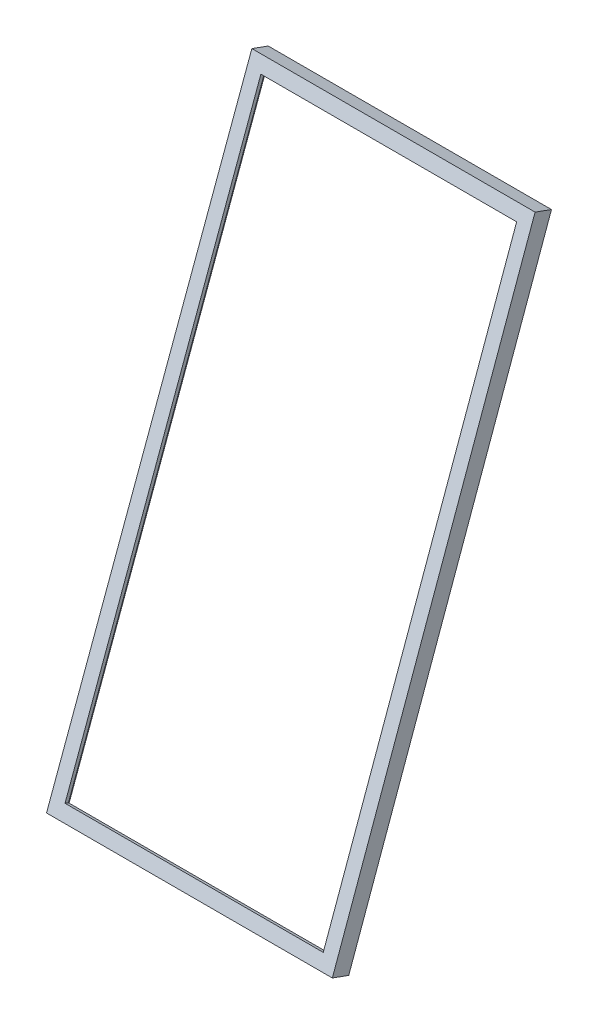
ISO-10303-21;
HEADER;
FILE_DESCRIPTION(('STEP AP214'),'2;1');
FILE_NAME('part.step','',(''),(''),'','','');
FILE_SCHEMA(('AUTOMOTIVE_DESIGN { 1 0 10303 214 1 1 1 1 }'));
ENDSEC;
DATA;
#1=APPLICATION_CONTEXT('core data for automotive mechanical design processes');
#2=APPLICATION_PROTOCOL_DEFINITION('international standard','automotive_design',2000,#1);
#3=PRODUCT_CONTEXT('',#1,'mechanical');
#4=PRODUCT('Part','Part','',(#3));
#5=PRODUCT_RELATED_PRODUCT_CATEGORY('part','',(#4));
#6=PRODUCT_DEFINITION_FORMATION('','',#4);
#7=PRODUCT_DEFINITION_CONTEXT('part definition',#1,'design');
#8=PRODUCT_DEFINITION('design','',#6,#7);
#9=PRODUCT_DEFINITION_SHAPE('','',#8);
#10=(LENGTH_UNIT() NAMED_UNIT(*) SI_UNIT(.MILLI.,.METRE.));
#11=(NAMED_UNIT(*) PLANE_ANGLE_UNIT() SI_UNIT($,.RADIAN.));
#12=(NAMED_UNIT(*) SI_UNIT($,.STERADIAN.) SOLID_ANGLE_UNIT());
#13=UNCERTAINTY_MEASURE_WITH_UNIT(LENGTH_MEASURE(1.E-05),#10,'distance_accuracy_value','');
#14=(GEOMETRIC_REPRESENTATION_CONTEXT(3) GLOBAL_UNCERTAINTY_ASSIGNED_CONTEXT((#13)) GLOBAL_UNIT_ASSIGNED_CONTEXT((#10,
#11,#12)) REPRESENTATION_CONTEXT('',''));
#15=CARTESIAN_POINT('',(0.,0.,0.));
#16=DIRECTION('',(0.,0.,1.));
#17=DIRECTION('',(1.,0.,0.));
#18=AXIS2_PLACEMENT_3D('',#15,#16,#17);
#19=CARTESIAN_POINT('',(1481.83846153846,63.6363802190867,-44.445303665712));
#20=DIRECTION('',(0.,0.939692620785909,-0.342020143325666));
#21=DIRECTION('',(0.,0.342020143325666,0.93969262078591));
#22=AXIS2_PLACEMENT_3D('',#19,#20,#21);
#23=PLANE('',#22);
#24=DIRECTION('',(-1.,0.,0.));
#25=VECTOR('',#24,1.);
#26=CARTESIAN_POINT('',(1481.83846153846,63.6363802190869,-44.4453036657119));
#27=LINE('',#26,#25);
#28=CARTESIAN_POINT('',(1481.83846153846,63.6363802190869,-44.4453036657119));
#29=VERTEX_POINT('',#28);
#30=CARTESIAN_POINT('',(75.1615384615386,63.6363802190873,-44.4453036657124));
#31=VERTEX_POINT('',#30);
#32=EDGE_CURVE('E187',#29,#31,#27,.T.);
#33=ORIENTED_EDGE('',*,*,#32,.T.);
#34=CARTESIAN_POINT('',(75.1615384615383,63.6363802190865,-44.4453036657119));
#35=DIRECTION('',(0.,0.342020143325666,0.939692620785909));
#36=VECTOR('',#35,1.);
#37=LINE('',#34,#36);
#38=CARTESIAN_POINT('',(75.1615384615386,70.4767830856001,-25.651451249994));
#39=VERTEX_POINT('',#38);
#40=EDGE_CURVE('E53',#31,#39,#37,.T.);
#41=ORIENTED_EDGE('',*,*,#40,.T.);
#42=DIRECTION('',(-1.,0.,0.));
#43=VECTOR('',#42,1.);
#44=CARTESIAN_POINT('',(1481.83846153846,70.4767830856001,-25.6514512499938));
#45=LINE('',#44,#43);
#46=CARTESIAN_POINT('',(1481.83846153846,70.4767830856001,-25.6514512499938));
#47=VERTEX_POINT('',#46);
#48=EDGE_CURVE('E178',#47,#39,#45,.T.);
#49=ORIENTED_EDGE('',*,*,#48,.F.);
#50=DIRECTION('',(0.,-0.342020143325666,-0.939692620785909));
#51=VECTOR('',#50,1.);
#52=CARTESIAN_POINT('',(1481.83846153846,63.6363802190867,-44.445303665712));
#53=LINE('',#52,#51);
#54=EDGE_CURVE('E263',#47,#29,#53,.T.);
#55=ORIENTED_EDGE('',*,*,#54,.T.);
#56=EDGE_LOOP('',(#33,#41,#49,#55));
#57=FACE_BOUND('',#56,.T.);
#58=ADVANCED_FACE('F42',(#57),#23,.T.);
#59=CARTESIAN_POINT('',(1557.,4.44089209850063E-13,2.22044604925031E-13));
#60=DIRECTION('',(0.,-0.939692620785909,0.342020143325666));
#61=DIRECTION('',(0.,-0.342020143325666,-0.939692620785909));
#62=AXIS2_PLACEMENT_3D('',#59,#60,#61);
#63=PLANE('',#62);
#64=DIRECTION('',(-1.,0.,0.));
#65=VECTOR('',#64,1.);
#66=CARTESIAN_POINT('',(1557.,1.60388440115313E-13,0.));
#67=LINE('',#66,#65);
#68=CARTESIAN_POINT('',(1557.,1.60388440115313E-13,0.));
#69=VERTEX_POINT('',#68);
#70=CARTESIAN_POINT('',(-1.10588621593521E-13,3.33066907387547E-13,-1.66533453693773E-13));
#71=VERTEX_POINT('',#70);
#72=EDGE_CURVE('E186',#69,#71,#67,.T.);
#73=ORIENTED_EDGE('',*,*,#72,.T.);
#74=CARTESIAN_POINT('',(4.44089209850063E-13,1.64183213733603E-13,0.));
#75=DIRECTION('',(0.,-0.342020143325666,-0.939692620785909));
#76=VECTOR('',#75,1.);
#77=LINE('',#74,#76);
#78=CARTESIAN_POINT('',(0.,-32.4919136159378,-89.2707989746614));
#79=VERTEX_POINT('',#78);
#80=EDGE_CURVE('E12',#71,#79,#77,.T.);
#81=ORIENTED_EDGE('',*,*,#80,.T.);
#82=DIRECTION('',(-1.,0.,0.));
#83=VECTOR('',#82,1.);
#84=CARTESIAN_POINT('',(1557.,-32.4919136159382,-89.2707989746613));
#85=LINE('',#84,#83);
#86=CARTESIAN_POINT('',(1557.,-32.4919136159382,-89.2707989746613));
#87=VERTEX_POINT('',#86);
#88=EDGE_CURVE('E227',#87,#79,#85,.T.);
#89=ORIENTED_EDGE('',*,*,#88,.F.);
#90=DIRECTION('',(0.,0.342020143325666,0.939692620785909));
#91=VECTOR('',#90,1.);
#92=CARTESIAN_POINT('',(1557.,4.44089209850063E-13,2.22044604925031E-13));
#93=LINE('',#92,#91);
#94=EDGE_CURVE('E267',#87,#69,#93,.T.);
#95=ORIENTED_EDGE('',*,*,#94,.T.);
#96=EDGE_LOOP('',(#73,#81,#89,#95));
#97=FACE_BOUND('',#96,.T.);
#98=ADVANCED_FACE('F207',(#97),#63,.T.);
#99=CARTESIAN_POINT('',(1536.95692307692,-13.6981047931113,-96.1111859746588));
#100=DIRECTION('',(0.,0.939692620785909,-0.342020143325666));
#101=DIRECTION('',(0.,0.342020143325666,0.939692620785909));
#102=AXIS2_PLACEMENT_3D('',#99,#100,#101);
#103=PLANE('',#102);
#104=DIRECTION('',(-1.,0.,0.));
#105=VECTOR('',#104,1.);
#106=CARTESIAN_POINT('',(1536.95692307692,-13.6981047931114,-96.1111859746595));
#107=LINE('',#106,#105);
#108=CARTESIAN_POINT('',(1536.95692307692,-13.6981047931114,-96.1111859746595));
#109=VERTEX_POINT('',#108);
#110=CARTESIAN_POINT('',(20.0430769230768,-13.6981047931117,-96.1111859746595));
#111=VERTEX_POINT('',#110);
#112=EDGE_CURVE('E233',#109,#111,#107,.T.);
#113=ORIENTED_EDGE('',*,*,#112,.T.);
#114=CARTESIAN_POINT('',(20.0430769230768,-13.6981047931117,-96.1111859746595));
#115=DIRECTION('',(0.,0.342020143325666,0.939692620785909));
#116=VECTOR('',#115,1.);
#117=LINE('',#114,#116);
#118=CARTESIAN_POINT('',(20.0430769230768,11.9534059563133,-25.6342394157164));
#119=VERTEX_POINT('',#118);
#120=EDGE_CURVE('E63',#111,#119,#117,.T.);
#121=ORIENTED_EDGE('',*,*,#120,.T.);
#122=DIRECTION('',(-1.,0.,0.));
#123=VECTOR('',#122,1.);
#124=CARTESIAN_POINT('',(1536.95692307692,11.9534059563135,-25.6342394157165));
#125=LINE('',#124,#123);
#126=CARTESIAN_POINT('',(1536.95692307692,11.9534059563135,-25.6342394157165));
#127=VERTEX_POINT('',#126);
#128=EDGE_CURVE('E74',#127,#119,#125,.T.);
#129=ORIENTED_EDGE('',*,*,#128,.F.);
#130=DIRECTION('',(0.,-0.342020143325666,-0.939692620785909));
#131=VECTOR('',#130,1.);
#132=CARTESIAN_POINT('',(1536.95692307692,-13.6981047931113,-96.1111859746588));
#133=LINE('',#132,#131);
#134=EDGE_CURVE('E259',#127,#109,#133,.T.);
#135=ORIENTED_EDGE('',*,*,#134,.T.);
#136=EDGE_LOOP('',(#113,#121,#129,#135));
#137=FACE_BOUND('',#136,.T.);
#138=ADVANCED_FACE('F44',(#137),#103,.T.);
#139=CARTESIAN_POINT('',(1475.16153846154,2976.6767477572,-1104.70528866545));
#140=DIRECTION('',(0.999997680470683,0.00202395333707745,-0.000736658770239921));
#141=DIRECTION('',(-0.00202395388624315,0.999997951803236,0.));
#142=AXIS2_PLACEMENT_3D('',#139,#140,#141);
#143=PLANE('',#142);
#144=ORIENTED_EDGE('',*,*,#54,.F.);
#145=DIRECTION('',(0.00215384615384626,-0.939690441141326,0.342019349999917));
#146=VECTOR('',#145,1.);
#147=CARTESIAN_POINT('',(1475.16153846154,2983.51715062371,-1085.91143624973));
#148=LINE('',#147,#146);
#149=CARTESIAN_POINT('',(1475.16153846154,2983.51715062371,-1085.91143624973));
#150=VERTEX_POINT('',#149);
#151=EDGE_CURVE('E181',#150,#47,#148,.T.);
#152=ORIENTED_EDGE('',*,*,#151,.F.);
#153=DIRECTION('',(0.,0.342020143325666,0.939692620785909));
#154=VECTOR('',#153,1.);
#155=CARTESIAN_POINT('',(1475.16153846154,2976.6767477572,-1104.70528866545));
#156=LINE('',#155,#154);
#157=CARTESIAN_POINT('',(1475.16153846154,2976.6767477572,-1104.70528866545));
#158=VERTEX_POINT('',#157);
#159=EDGE_CURVE('E290',#158,#150,#156,.T.);
#160=ORIENTED_EDGE('',*,*,#159,.F.);
#161=DIRECTION('',(0.00215384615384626,-0.939690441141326,0.342019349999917));
#162=VECTOR('',#161,1.);
#163=CARTESIAN_POINT('',(1475.16153846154,2976.6767477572,-1104.70528866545));
#164=LINE('',#163,#162);
#165=EDGE_CURVE('E281',#158,#29,#164,.T.);
#166=ORIENTED_EDGE('',*,*,#165,.T.);
#167=EDGE_LOOP('',(#144,#152,#160,#166));
#168=FACE_BOUND('',#167,.T.);
#169=ADVANCED_FACE('F425',(#168),#143,.F.);
#170=CARTESIAN_POINT('',(1550.,3053.99393370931,-1111.56288749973));
#171=DIRECTION('',(-0.999997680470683,-0.00202395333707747,0.000736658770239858));
#172=DIRECTION('',(0.00202395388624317,-0.999997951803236,0.));
#173=AXIS2_PLACEMENT_3D('',#170,#171,#172);
#174=PLANE('',#173);
#175=ORIENTED_EDGE('',*,*,#94,.F.);
#176=DIRECTION('',(0.00215384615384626,-0.939690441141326,0.342019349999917));
#177=VECTOR('',#176,1.);
#178=CARTESIAN_POINT('',(1550.,3021.50202009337,-1200.83368647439));
#179=LINE('',#178,#177);
#180=CARTESIAN_POINT('',(1550.,3021.50202009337,-1200.83368647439));
#181=VERTEX_POINT('',#180);
#182=EDGE_CURVE('E272',#181,#87,#179,.T.);
#183=ORIENTED_EDGE('',*,*,#182,.F.);
#184=DIRECTION('',(0.,-0.342020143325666,-0.939692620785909));
#185=VECTOR('',#184,1.);
#186=CARTESIAN_POINT('',(1550.,3053.99393370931,-1111.56288749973));
#187=LINE('',#186,#185);
#188=CARTESIAN_POINT('',(1550.,3053.99393370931,-1111.56288749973));
#189=VERTEX_POINT('',#188);
#190=EDGE_CURVE('E322',#189,#181,#187,.T.);
#191=ORIENTED_EDGE('',*,*,#190,.F.);
#192=DIRECTION('',(0.00215384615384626,-0.939690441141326,0.342019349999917));
#193=VECTOR('',#192,1.);
#194=CARTESIAN_POINT('',(1550.,3053.99393370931,-1111.56288749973));
#195=LINE('',#194,#193);
#196=EDGE_CURVE('E275',#189,#69,#195,.T.);
#197=ORIENTED_EDGE('',*,*,#196,.T.);
#198=EDGE_LOOP('',(#175,#183,#191,#197));
#199=FACE_BOUND('',#198,.T.);
#200=ADVANCED_FACE('F335',(#199),#174,.F.);
#201=CARTESIAN_POINT('',(1530.04307692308,3002.70821127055,-1193.99329947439));
#202=DIRECTION('',(0.999997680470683,0.0020239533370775,-0.000736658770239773));
#203=DIRECTION('',(-0.0020239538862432,0.999997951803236,0.));
#204=AXIS2_PLACEMENT_3D('',#201,#202,#203);
#205=PLANE('',#204);
#206=ORIENTED_EDGE('',*,*,#134,.F.);
#207=DIRECTION('',(0.00215384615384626,-0.939690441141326,0.342019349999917));
#208=VECTOR('',#207,1.);
#209=CARTESIAN_POINT('',(1530.04307692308,3028.35972201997,-1123.51635291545));
#210=LINE('',#209,#208);
#211=CARTESIAN_POINT('',(1530.04307692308,3028.35972201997,-1123.51635291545));
#212=VERTEX_POINT('',#211);
#213=EDGE_CURVE('E264',#212,#127,#210,.T.);
#214=ORIENTED_EDGE('',*,*,#213,.F.);
#215=DIRECTION('',(0.,0.342020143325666,0.939692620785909));
#216=VECTOR('',#215,1.);
#217=CARTESIAN_POINT('',(1530.04307692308,3002.70821127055,-1193.99329947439));
#218=LINE('',#217,#216);
#219=CARTESIAN_POINT('',(1530.04307692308,3002.70821127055,-1193.99329947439));
#220=VERTEX_POINT('',#219);
#221=EDGE_CURVE('E285',#220,#212,#218,.T.);
#222=ORIENTED_EDGE('',*,*,#221,.F.);
#223=DIRECTION('',(0.00215384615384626,-0.939690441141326,0.342019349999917));
#224=VECTOR('',#223,1.);
#225=CARTESIAN_POINT('',(1530.04307692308,3002.70821127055,-1193.99329947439));
#226=LINE('',#225,#224);
#227=EDGE_CURVE('E268',#220,#109,#226,.T.);
#228=ORIENTED_EDGE('',*,*,#227,.T.);
#229=EDGE_LOOP('',(#206,#214,#222,#228));
#230=FACE_BOUND('',#229,.T.);
#231=ADVANCED_FACE('F208',(#230),#205,.F.);
#232=CARTESIAN_POINT('',(81.838461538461,2976.6767477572,-1104.70528866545));
#233=DIRECTION('',(0.,-0.939692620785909,0.342020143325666));
#234=DIRECTION('',(0.,-0.342020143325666,-0.93969262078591));
#235=AXIS2_PLACEMENT_3D('',#232,#233,#234);
#236=PLANE('',#235);
#237=DIRECTION('',(1.,0.,0.));
#238=VECTOR('',#237,1.);
#239=CARTESIAN_POINT('',(81.838461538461,2976.6767477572,-1104.70528866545));
#240=LINE('',#239,#238);
#241=CARTESIAN_POINT('',(81.838461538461,2976.6767477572,-1104.70528866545));
#242=VERTEX_POINT('',#241);
#243=EDGE_CURVE('E286',#242,#158,#240,.T.);
#244=ORIENTED_EDGE('',*,*,#243,.T.);
#245=ORIENTED_EDGE('',*,*,#159,.T.);
#246=DIRECTION('',(1.,0.,0.));
#247=VECTOR('',#246,1.);
#248=CARTESIAN_POINT('',(81.8384615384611,2983.51715062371,-1085.91143624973));
#249=LINE('',#248,#247);
#250=CARTESIAN_POINT('',(81.8384615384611,2983.51715062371,-1085.91143624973));
#251=VERTEX_POINT('',#250);
#252=EDGE_CURVE('E307',#251,#150,#249,.T.);
#253=ORIENTED_EDGE('',*,*,#252,.F.);
#254=DIRECTION('',(0.,-0.342020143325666,-0.939692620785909));
#255=VECTOR('',#254,1.);
#256=CARTESIAN_POINT('',(81.838461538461,2976.6767477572,-1104.70528866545));
#257=LINE('',#256,#255);
#258=EDGE_CURVE('E170',#251,#242,#257,.T.);
#259=ORIENTED_EDGE('',*,*,#258,.T.);
#260=EDGE_LOOP('',(#244,#245,#253,#259));
#261=FACE_BOUND('',#260,.T.);
#262=ADVANCED_FACE('F401',(#261),#236,.T.);
#263=CARTESIAN_POINT('',(6.99999999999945,3053.99393370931,-1111.56288749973));
#264=DIRECTION('',(0.,0.939692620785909,-0.342020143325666));
#265=DIRECTION('',(0.,0.342020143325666,0.939692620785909));
#266=AXIS2_PLACEMENT_3D('',#263,#264,#265);
#267=PLANE('',#266);
#268=DIRECTION('',(1.,0.,0.));
#269=VECTOR('',#268,1.);
#270=CARTESIAN_POINT('',(6.99999999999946,3053.99393370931,-1111.56288749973));
#271=LINE('',#270,#269);
#272=CARTESIAN_POINT('',(6.99999999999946,3053.99393370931,-1111.56288749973));
#273=VERTEX_POINT('',#272);
#274=EDGE_CURVE('E303',#273,#189,#271,.T.);
#275=ORIENTED_EDGE('',*,*,#274,.T.);
#276=ORIENTED_EDGE('',*,*,#190,.T.);
#277=DIRECTION('',(1.,0.,0.));
#278=VECTOR('',#277,1.);
#279=CARTESIAN_POINT('',(6.99999999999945,3021.50202009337,-1200.83368647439));
#280=LINE('',#279,#278);
#281=CARTESIAN_POINT('',(6.99999999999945,3021.50202009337,-1200.83368647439));
#282=VERTEX_POINT('',#281);
#283=EDGE_CURVE('E299',#282,#181,#280,.T.);
#284=ORIENTED_EDGE('',*,*,#283,.F.);
#285=DIRECTION('',(0.,0.342020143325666,0.939692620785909));
#286=VECTOR('',#285,1.);
#287=CARTESIAN_POINT('',(6.99999999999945,3053.99393370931,-1111.56288749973));
#288=LINE('',#287,#286);
#289=EDGE_CURVE('E174',#282,#273,#288,.T.);
#290=ORIENTED_EDGE('',*,*,#289,.T.);
#291=EDGE_LOOP('',(#275,#276,#284,#290));
#292=FACE_BOUND('',#291,.T.);
#293=ADVANCED_FACE('F419',(#292),#267,.T.);
#294=CARTESIAN_POINT('',(26.9569230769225,3002.70821127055,-1193.99329947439));
#295=DIRECTION('',(0.,-0.939692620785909,0.342020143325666));
#296=DIRECTION('',(0.,-0.342020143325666,-0.939692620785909));
#297=AXIS2_PLACEMENT_3D('',#294,#295,#296);
#298=PLANE('',#297);
#299=DIRECTION('',(1.,0.,0.));
#300=VECTOR('',#299,1.);
#301=CARTESIAN_POINT('',(26.9569230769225,3002.70821127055,-1193.99329947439));
#302=LINE('',#301,#300);
#303=CARTESIAN_POINT('',(26.9569230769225,3002.70821127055,-1193.99329947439));
#304=VERTEX_POINT('',#303);
#305=EDGE_CURVE('E295',#304,#220,#302,.T.);
#306=ORIENTED_EDGE('',*,*,#305,.T.);
#307=ORIENTED_EDGE('',*,*,#221,.T.);
#308=DIRECTION('',(1.,0.,0.));
#309=VECTOR('',#308,1.);
#310=CARTESIAN_POINT('',(26.9569230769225,3028.35972201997,-1123.51635291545));
#311=LINE('',#310,#309);
#312=CARTESIAN_POINT('',(26.9569230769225,3028.35972201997,-1123.51635291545));
#313=VERTEX_POINT('',#312);
#314=EDGE_CURVE('E291',#313,#212,#311,.T.);
#315=ORIENTED_EDGE('',*,*,#314,.F.);
#316=DIRECTION('',(0.,-0.342020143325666,-0.939692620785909));
#317=VECTOR('',#316,1.);
#318=CARTESIAN_POINT('',(26.9569230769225,3002.70821127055,-1193.99329947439));
#319=LINE('',#318,#317);
#320=EDGE_CURVE('E312',#313,#304,#319,.T.);
#321=ORIENTED_EDGE('',*,*,#320,.T.);
#322=EDGE_LOOP('',(#306,#307,#315,#321));
#323=FACE_BOUND('',#322,.T.);
#324=ADVANCED_FACE('F396',(#323),#298,.T.);
#325=CARTESIAN_POINT('',(82.5213909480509,3274.62850119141,-1213.15085816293));
#326=DIRECTION('',(-0.999997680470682,0.00202395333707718,-0.000736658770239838));
#327=DIRECTION('',(-0.00202395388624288,-0.999997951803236,0.));
#328=AXIS2_PLACEMENT_3D('',#325,#326,#327);
#329=PLANE('',#328);
#330=ORIENTED_EDGE('',*,*,#258,.F.);
#331=DIRECTION('',(-0.00215384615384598,-0.939690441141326,0.342019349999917));
#332=VECTOR('',#331,1.);
#333=CARTESIAN_POINT('',(82.5213909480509,3281.46890405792,-1194.35700574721));
#334=LINE('',#333,#332);
#335=EDGE_CURVE('E162',#251,#39,#334,.T.);
#336=ORIENTED_EDGE('',*,*,#335,.T.);
#337=ORIENTED_EDGE('',*,*,#40,.F.);
#338=DIRECTION('',(-0.00215384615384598,-0.939690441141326,0.342019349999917));
#339=VECTOR('',#338,1.);
#340=CARTESIAN_POINT('',(82.5213909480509,3274.62850119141,-1213.15085816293));
#341=LINE('',#340,#339);
#342=EDGE_CURVE('E175',#242,#31,#341,.T.);
#343=ORIENTED_EDGE('',*,*,#342,.F.);
#344=EDGE_LOOP('',(#330,#336,#337,#343));
#345=FACE_BOUND('',#344,.T.);
#346=ADVANCED_FACE('F164',(#345),#329,.F.);
#347=CARTESIAN_POINT('',(27.5213909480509,3274.62850119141,-1213.15085816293));
#348=DIRECTION('',(0.,0.342020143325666,0.939692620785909));
#349=DIRECTION('',(0.,-0.93969262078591,0.342020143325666));
#350=AXIS2_PLACEMENT_3D('',#347,#348,#349);
#351=PLANE('',#350);
#352=DIRECTION('',(-0.00215384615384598,-0.939690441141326,0.342019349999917));
#353=VECTOR('',#352,1.);
#354=CARTESIAN_POINT('',(27.5213909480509,3274.62850119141,-1213.15085816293));
#355=LINE('',#354,#353);
#356=EDGE_CURVE('E376',#313,#119,#355,.T.);
#357=ORIENTED_EDGE('',*,*,#356,.F.);
#358=ORIENTED_EDGE('',*,*,#314,.T.);
#359=ORIENTED_EDGE('',*,*,#213,.T.);
#360=ORIENTED_EDGE('',*,*,#128,.T.);
#361=EDGE_LOOP('',(#357,#358,#359,#360));
#362=FACE_BOUND('',#361,.T.);
#363=ORIENTED_EDGE('',*,*,#243,.F.);
#364=ORIENTED_EDGE('',*,*,#342,.T.);
#365=ORIENTED_EDGE('',*,*,#32,.F.);
#366=ORIENTED_EDGE('',*,*,#165,.F.);
#367=EDGE_LOOP('',(#363,#364,#365,#366));
#368=FACE_BOUND('',#367,.T.);
#369=ADVANCED_FACE('F369',(#362,#368),#351,.F.);
#370=CARTESIAN_POINT('',(27.5213909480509,3248.97699044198,-1283.62780472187));
#371=DIRECTION('',(-0.999997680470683,0.00202395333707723,-0.000736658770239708));
#372=DIRECTION('',(-0.00202395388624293,-0.999997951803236,0.));
#373=AXIS2_PLACEMENT_3D('',#370,#371,#372);
#374=PLANE('',#373);
#375=ORIENTED_EDGE('',*,*,#320,.F.);
#376=ORIENTED_EDGE('',*,*,#356,.T.);
#377=ORIENTED_EDGE('',*,*,#120,.F.);
#378=DIRECTION('',(-0.00215384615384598,-0.939690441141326,0.342019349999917));
#379=VECTOR('',#378,1.);
#380=CARTESIAN_POINT('',(27.5213909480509,3248.97699044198,-1283.62780472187));
#381=LINE('',#380,#379);
#382=EDGE_CURVE('E384',#304,#111,#381,.T.);
#383=ORIENTED_EDGE('',*,*,#382,.F.);
#384=EDGE_LOOP('',(#375,#376,#377,#383));
#385=FACE_BOUND('',#384,.T.);
#386=ADVANCED_FACE('F365',(#385),#374,.F.);
#387=CARTESIAN_POINT('',(7.52139094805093,3248.97699044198,-1283.62780472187));
#388=DIRECTION('',(0.,0.342020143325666,0.939692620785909));
#389=DIRECTION('',(0.,-0.93969262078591,0.342020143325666));
#390=AXIS2_PLACEMENT_3D('',#387,#388,#389);
#391=PLANE('',#390);
#392=DIRECTION('',(-0.00215384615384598,-0.939690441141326,0.342019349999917));
#393=VECTOR('',#392,1.);
#394=CARTESIAN_POINT('',(7.52139094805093,3248.97699044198,-1283.62780472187));
#395=LINE('',#394,#393);
#396=EDGE_CURVE('E342',#282,#79,#395,.T.);
#397=ORIENTED_EDGE('',*,*,#396,.F.);
#398=ORIENTED_EDGE('',*,*,#283,.T.);
#399=ORIENTED_EDGE('',*,*,#182,.T.);
#400=ORIENTED_EDGE('',*,*,#88,.T.);
#401=EDGE_LOOP('',(#397,#398,#399,#400));
#402=FACE_BOUND('',#401,.T.);
#403=ORIENTED_EDGE('',*,*,#305,.F.);
#404=ORIENTED_EDGE('',*,*,#382,.T.);
#405=ORIENTED_EDGE('',*,*,#112,.F.);
#406=ORIENTED_EDGE('',*,*,#227,.F.);
#407=EDGE_LOOP('',(#403,#404,#405,#406));
#408=FACE_BOUND('',#407,.T.);
#409=ADVANCED_FACE('F362',(#402,#408),#391,.F.);
#410=CARTESIAN_POINT('',(7.52139094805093,3281.46890405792,-1194.35700574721));
#411=DIRECTION('',(0.999997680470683,-0.00202395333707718,0.000736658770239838));
#412=DIRECTION('',(0.00202395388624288,0.999997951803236,0.));
#413=AXIS2_PLACEMENT_3D('',#410,#411,#412);
#414=PLANE('',#413);
#415=ORIENTED_EDGE('',*,*,#289,.F.);
#416=ORIENTED_EDGE('',*,*,#396,.T.);
#417=ORIENTED_EDGE('',*,*,#80,.F.);
#418=DIRECTION('',(-0.00215384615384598,-0.939690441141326,0.342019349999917));
#419=VECTOR('',#418,1.);
#420=CARTESIAN_POINT('',(7.52139094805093,3281.46890405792,-1194.35700574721));
#421=LINE('',#420,#419);
#422=EDGE_CURVE('E337',#273,#71,#421,.T.);
#423=ORIENTED_EDGE('',*,*,#422,.F.);
#424=EDGE_LOOP('',(#415,#416,#417,#423));
#425=FACE_BOUND('',#424,.T.);
#426=ADVANCED_FACE('F345',(#425),#414,.F.);
#427=CARTESIAN_POINT('',(82.5213909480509,3281.46890405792,-1194.35700574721));
#428=DIRECTION('',(0.,-0.342020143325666,-0.939692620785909));
#429=DIRECTION('',(0.,0.93969262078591,-0.342020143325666));
#430=AXIS2_PLACEMENT_3D('',#427,#428,#429);
#431=PLANE('',#430);
#432=ORIENTED_EDGE('',*,*,#335,.F.);
#433=ORIENTED_EDGE('',*,*,#252,.T.);
#434=ORIENTED_EDGE('',*,*,#151,.T.);
#435=ORIENTED_EDGE('',*,*,#48,.T.);
#436=EDGE_LOOP('',(#432,#433,#434,#435));
#437=FACE_BOUND('',#436,.T.);
#438=ORIENTED_EDGE('',*,*,#274,.F.);
#439=ORIENTED_EDGE('',*,*,#422,.T.);
#440=ORIENTED_EDGE('',*,*,#72,.F.);
#441=ORIENTED_EDGE('',*,*,#196,.F.);
#442=EDGE_LOOP('',(#438,#439,#440,#441));
#443=FACE_BOUND('',#442,.T.);
#444=ADVANCED_FACE('F179',(#437,#443),#431,.F.);
#445=CLOSED_SHELL('',(#58,#98,#138,#169,#200,#231,#262,#293,#324,#346,#369,#386,#409,#426,#444));
#446=MANIFOLD_SOLID_BREP('B2',#445);
#447=ADVANCED_BREP_SHAPE_REPRESENTATION('',(#18,#446),#14);
#448=SHAPE_DEFINITION_REPRESENTATION(#9,#447);
ENDSEC;
END-ISO-10303-21;
